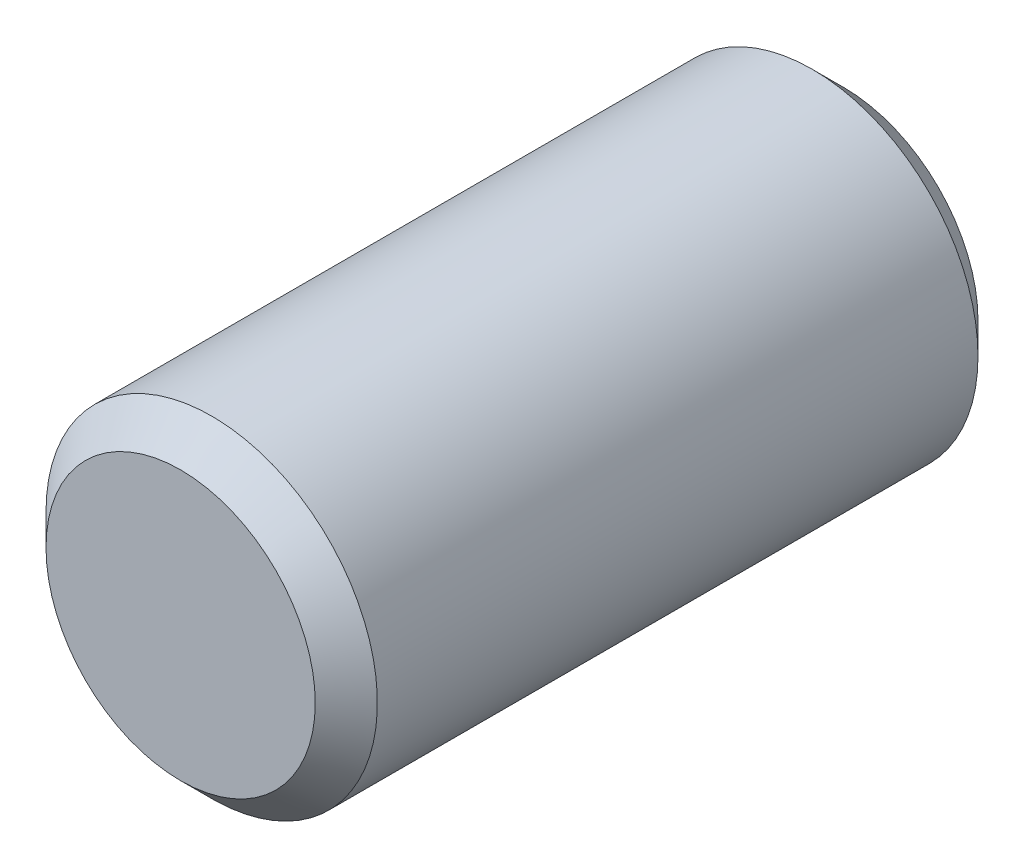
from build123d import *

# Parameters (mm, degrees)
ESQUISSE1_R          = 8
BASE_EXTRUSION_DEPTH = 32
CHANFREIN1_SIZE      = 1.5


with BuildPart() as part:
    # Esquisse1 → Base-Extrusion (new body)
    with BuildSketch(Plane.XY):
        with Locations(Location((0, 0, 0), (0, 0, 180))):
            Circle(ESQUISSE1_R)
    extrude(amount=BASE_EXTRUSION_DEPTH)

    # Chanfrein1
    chanfrein1_edges = [part.edges().sort_by_distance(p)[0] for p in [
        (8, 0, 0),
        (8, 0, 32),
    ]]
    chamfer(chanfrein1_edges, length=CHANFREIN1_SIZE)


solid = part.part
